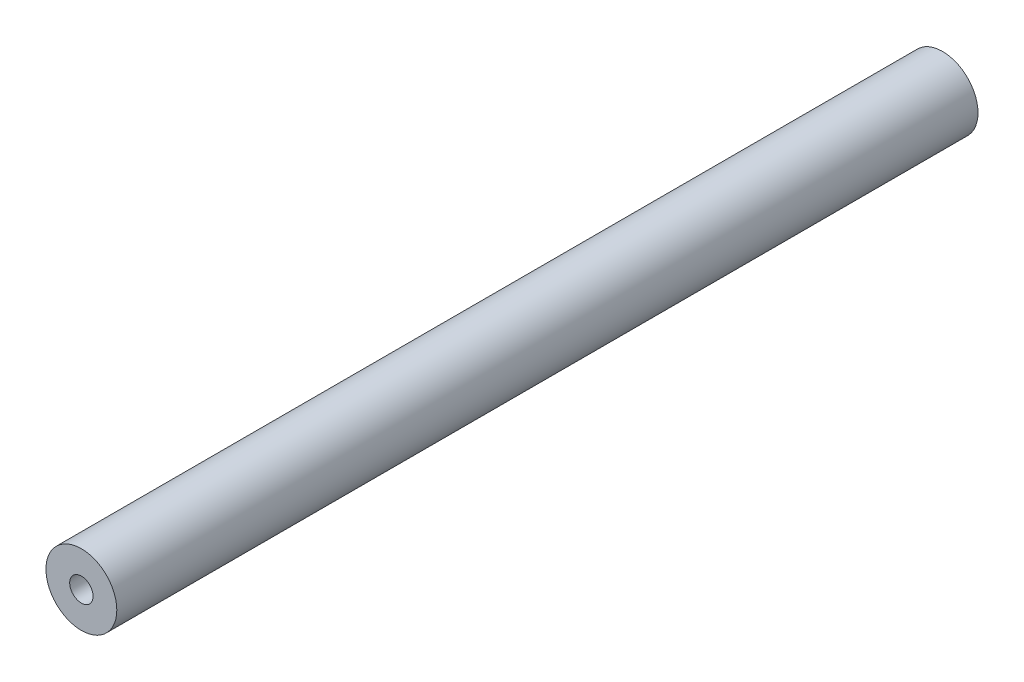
ISO-10303-21;
HEADER;
FILE_DESCRIPTION(('STEP AP214'),'2;1');
FILE_NAME('part.step','',(''),(''),'','','');
FILE_SCHEMA(('AUTOMOTIVE_DESIGN { 1 0 10303 214 1 1 1 1 }'));
ENDSEC;
DATA;
#1=APPLICATION_CONTEXT('core data for automotive mechanical design processes');
#2=APPLICATION_PROTOCOL_DEFINITION('international standard','automotive_design',2000,#1);
#3=PRODUCT_CONTEXT('',#1,'mechanical');
#4=PRODUCT('Part','Part','',(#3));
#5=PRODUCT_RELATED_PRODUCT_CATEGORY('part','',(#4));
#6=PRODUCT_DEFINITION_FORMATION('','',#4);
#7=PRODUCT_DEFINITION_CONTEXT('part definition',#1,'design');
#8=PRODUCT_DEFINITION('design','',#6,#7);
#9=PRODUCT_DEFINITION_SHAPE('','',#8);
#10=(LENGTH_UNIT() NAMED_UNIT(*) SI_UNIT(.MILLI.,.METRE.));
#11=(NAMED_UNIT(*) PLANE_ANGLE_UNIT() SI_UNIT($,.RADIAN.));
#12=(NAMED_UNIT(*) SI_UNIT($,.STERADIAN.) SOLID_ANGLE_UNIT());
#13=UNCERTAINTY_MEASURE_WITH_UNIT(LENGTH_MEASURE(1.E-05),#10,'distance_accuracy_value','');
#14=(GEOMETRIC_REPRESENTATION_CONTEXT(3) GLOBAL_UNCERTAINTY_ASSIGNED_CONTEXT((#13)) GLOBAL_UNIT_ASSIGNED_CONTEXT((#10,
#11,#12)) REPRESENTATION_CONTEXT('',''));
#15=CARTESIAN_POINT('',(0.,0.,0.));
#16=DIRECTION('',(0.,0.,1.));
#17=DIRECTION('',(1.,0.,0.));
#18=AXIS2_PLACEMENT_3D('',#15,#16,#17);
#19=CARTESIAN_POINT('',(374.720096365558,28.26,47.4927569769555));
#20=DIRECTION('',(0.,0.,1.));
#21=DIRECTION('',(1.,0.,0.));
#22=AXIS2_PLACEMENT_3D('',#19,#20,#21);
#23=CYLINDRICAL_SURFACE('',#22,5.);
#24=CARTESIAN_POINT('',(374.720096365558,28.26,47.4927569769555));
#25=DIRECTION('',(0.,0.,1.));
#26=DIRECTION('',(1.,0.,0.));
#27=AXIS2_PLACEMENT_3D('',#24,#25,#26);
#28=CIRCLE('',#27,5.);
#29=CARTESIAN_POINT('',(379.720096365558,28.26,47.4927569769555));
#30=VERTEX_POINT('',#29);
#31=EDGE_CURVE('E11',#30,#30,#28,.T.);
#32=ORIENTED_EDGE('',*,*,#31,.T.);
#33=EDGE_LOOP('',(#32));
#34=FACE_BOUND('',#33,.T.);
#35=CARTESIAN_POINT('',(374.720096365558,28.26,169.022756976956));
#36=DIRECTION('',(0.,0.,1.));
#37=DIRECTION('',(1.,0.,0.));
#38=AXIS2_PLACEMENT_3D('',#35,#36,#37);
#39=CIRCLE('',#38,5.00000000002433);
#40=CARTESIAN_POINT('',(379.720096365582,28.26,169.022756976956));
#41=VERTEX_POINT('',#40);
#42=EDGE_CURVE('E39',#41,#41,#39,.T.);
#43=ORIENTED_EDGE('',*,*,#42,.F.);
#44=EDGE_LOOP('',(#43));
#45=FACE_BOUND('',#44,.T.);
#46=ADVANCED_FACE('F16',(#34,#45),#23,.T.);
#47=CARTESIAN_POINT('',(374.720096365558,28.26,59.6927569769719));
#48=DIRECTION('',(0.,0.,-1.));
#49=DIRECTION('',(-1.,0.,0.));
#50=AXIS2_PLACEMENT_3D('',#47,#48,#49);
#51=CONICAL_SURFACE('',#50,1.64999999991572,1.02974425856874);
#52=CARTESIAN_POINT('',(374.720096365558,28.2599999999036,60.684176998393));
#53=VERTEX_POINT('',#52);
#54=VERTEX_LOOP('',#53);
#55=FACE_BOUND('',#54,.T.);
#56=CARTESIAN_POINT('',(374.720096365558,28.26,59.6927569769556));
#57=DIRECTION('',(0.,0.,-1.));
#58=DIRECTION('',(-1.,0.,0.));
#59=AXIS2_PLACEMENT_3D('',#56,#57,#58);
#60=CIRCLE('',#59,1.65);
#61=CARTESIAN_POINT('',(373.070096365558,28.26,59.6927569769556));
#62=VERTEX_POINT('',#61);
#63=EDGE_CURVE('E38',#62,#62,#60,.T.);
#64=ORIENTED_EDGE('',*,*,#63,.T.);
#65=EDGE_LOOP('',(#64));
#66=FACE_BOUND('',#65,.T.);
#67=ADVANCED_FACE('F55',(#55,#66),#51,.F.);
#68=CARTESIAN_POINT('',(374.720096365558,28.26,47.4927569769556));
#69=DIRECTION('',(0.,0.,-1.));
#70=DIRECTION('',(-1.,0.,0.));
#71=AXIS2_PLACEMENT_3D('',#68,#69,#70);
#72=CYLINDRICAL_SURFACE('',#71,1.65);
#73=ORIENTED_EDGE('',*,*,#63,.F.);
#74=EDGE_LOOP('',(#73));
#75=FACE_BOUND('',#74,.T.);
#76=CARTESIAN_POINT('',(374.720096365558,28.26,47.4927569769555));
#77=DIRECTION('',(0.,0.,-1.));
#78=DIRECTION('',(-1.,0.,0.));
#79=AXIS2_PLACEMENT_3D('',#76,#77,#78);
#80=CIRCLE('',#79,1.65);
#81=CARTESIAN_POINT('',(373.070096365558,28.26,47.4927569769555));
#82=VERTEX_POINT('',#81);
#83=EDGE_CURVE('E20',#82,#82,#80,.T.);
#84=ORIENTED_EDGE('',*,*,#83,.T.);
#85=EDGE_LOOP('',(#84));
#86=FACE_BOUND('',#85,.T.);
#87=ADVANCED_FACE('F61',(#75,#86),#72,.F.);
#88=CARTESIAN_POINT('',(458.470096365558,-47.79,47.4927569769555));
#89=DIRECTION('',(0.,0.,1.));
#90=DIRECTION('',(1.,0.,0.));
#91=AXIS2_PLACEMENT_3D('',#88,#89,#90);
#92=PLANE('',#91);
#93=ORIENTED_EDGE('',*,*,#83,.F.);
#94=EDGE_LOOP('',(#93));
#95=FACE_BOUND('',#94,.T.);
#96=ORIENTED_EDGE('',*,*,#31,.F.);
#97=EDGE_LOOP('',(#96));
#98=FACE_BOUND('',#97,.T.);
#99=ADVANCED_FACE('F52',(#95,#98),#92,.F.);
#100=CARTESIAN_POINT('',(374.720096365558,28.26,169.022756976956));
#101=DIRECTION('',(0.,0.,1.));
#102=DIRECTION('',(1.,0.,0.));
#103=AXIS2_PLACEMENT_3D('',#100,#101,#102);
#104=PLANE('',#103);
#105=ORIENTED_EDGE('',*,*,#42,.T.);
#106=EDGE_LOOP('',(#105));
#107=FACE_BOUND('',#106,.T.);
#108=CARTESIAN_POINT('',(374.720096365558,28.26,169.022756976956));
#109=DIRECTION('',(0.,0.,1.));
#110=DIRECTION('',(1.,0.,0.));
#111=AXIS2_PLACEMENT_3D('',#108,#109,#110);
#112=CIRCLE('',#111,1.65);
#113=CARTESIAN_POINT('',(376.370096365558,28.26,169.022756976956));
#114=VERTEX_POINT('',#113);
#115=EDGE_CURVE('E44',#114,#114,#112,.T.);
#116=ORIENTED_EDGE('',*,*,#115,.F.);
#117=EDGE_LOOP('',(#116));
#118=FACE_BOUND('',#117,.T.);
#119=ADVANCED_FACE('F33',(#107,#118),#104,.T.);
#120=CARTESIAN_POINT('',(374.720096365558,28.26,161.322756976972));
#121=DIRECTION('',(0.,0.,1.));
#122=DIRECTION('',(1.,0.,0.));
#123=AXIS2_PLACEMENT_3D('',#120,#121,#122);
#124=CONICAL_SURFACE('',#123,1.64999999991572,1.02974425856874);
#125=CARTESIAN_POINT('',(374.720096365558,28.2600000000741,160.331336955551));
#126=VERTEX_POINT('',#125);
#127=VERTEX_LOOP('',#126);
#128=FACE_BOUND('',#127,.T.);
#129=CARTESIAN_POINT('',(374.720096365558,28.26,161.322756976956));
#130=DIRECTION('',(0.,0.,1.));
#131=DIRECTION('',(1.,0.,0.));
#132=AXIS2_PLACEMENT_3D('',#129,#130,#131);
#133=CIRCLE('',#132,1.65);
#134=CARTESIAN_POINT('',(376.370096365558,28.26,161.322756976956));
#135=VERTEX_POINT('',#134);
#136=EDGE_CURVE('E36',#135,#135,#133,.T.);
#137=ORIENTED_EDGE('',*,*,#136,.T.);
#138=EDGE_LOOP('',(#137));
#139=FACE_BOUND('',#138,.T.);
#140=ADVANCED_FACE('F18',(#128,#139),#124,.F.);
#141=CARTESIAN_POINT('',(374.720096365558,28.26,173.522756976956));
#142=DIRECTION('',(0.,0.,1.));
#143=DIRECTION('',(1.,0.,0.));
#144=AXIS2_PLACEMENT_3D('',#141,#142,#143);
#145=CYLINDRICAL_SURFACE('',#144,1.65);
#146=ORIENTED_EDGE('',*,*,#136,.F.);
#147=EDGE_LOOP('',(#146));
#148=FACE_BOUND('',#147,.T.);
#149=ORIENTED_EDGE('',*,*,#115,.T.);
#150=EDGE_LOOP('',(#149));
#151=FACE_BOUND('',#150,.T.);
#152=ADVANCED_FACE('F32',(#148,#151),#145,.F.);
#153=CLOSED_SHELL('',(#46,#67,#87,#99,#119,#140,#152));
#154=MANIFOLD_SOLID_BREP('B1',#153);
#155=ADVANCED_BREP_SHAPE_REPRESENTATION('',(#18,#154),#14);
#156=SHAPE_DEFINITION_REPRESENTATION(#9,#155);
ENDSEC;
END-ISO-10303-21;
